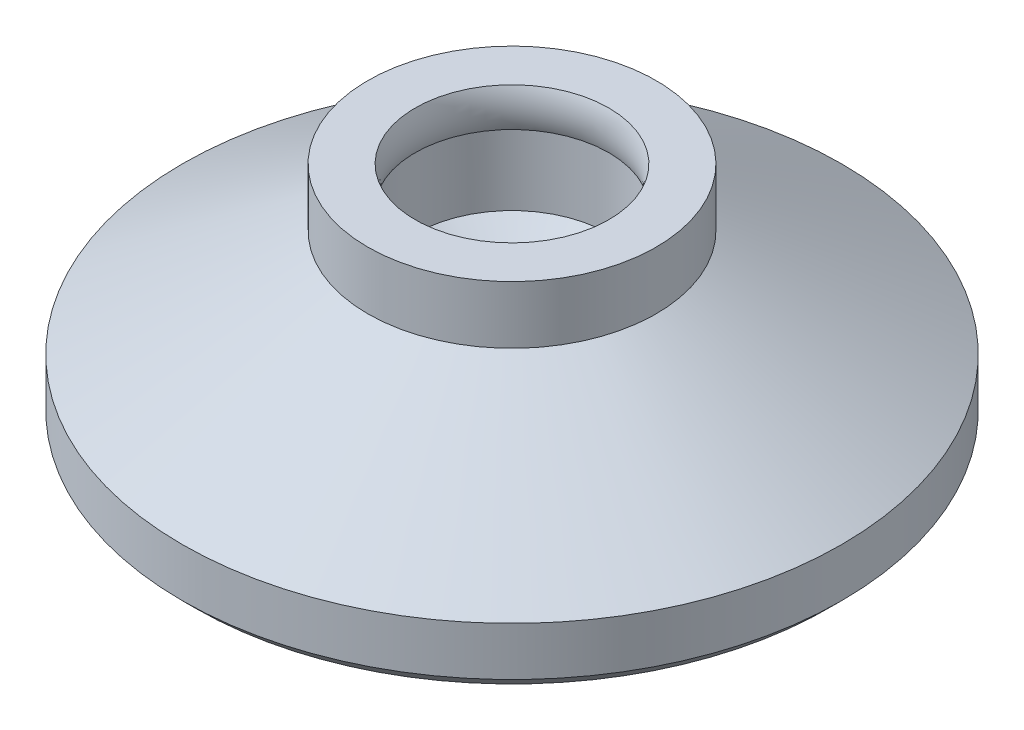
from build123d import *

# Parameters (mm, degrees)
SKETCH1_R      = 7
EXTRUDE1_DEPTH = 5.5
SKETCH3_R      = 16
EXTRUDE2_DEPTH = 3
CHAMFER1_SIZE  = 0.64


with BuildPart() as part:
    # Sketch1 → Extrude1 (new, symmetric)
    with BuildSketch(Plane(origin=(0, 0, 0), x_dir=(1, 0, 0), z_dir=(0, 1, 0))):
        with Locations(Location((0, 0, 0), (0, 0, 270))):
            Circle(SKETCH1_R)
    extrude(amount=EXTRUDE1_DEPTH, both=True)

    # Sketch3 → Extrude2 (add)
    with BuildSketch(Plane.XZ.offset(5.5)):
        with Locations(Location((0, 0, 0), (0, 0, 270))):
            Circle(SKETCH3_R)
    extrude(amount=-EXTRUDE2_DEPTH)

    # Sketch4 → Revolve1 (revolve)
    with BuildSketch(Plane.XY, mode=Mode.PRIVATE) as revolve1_sk:
        Polygon((-16, -2.5), (-7, 2.696152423), (-7, -2.5), align=None)
    revolve(revolve1_sk.sketch.rotate(Axis((0, 5.5, 0), (0, -1, 0)), 270), axis=Axis((0, 5.5, 0), (0, -1, 0)))

    # Chamfer1
    chamfer1_edges = [part.edges().sort_by_distance(p)[0] for p in [
        (0, -5.5, 16),
    ]]
    chamfer(chamfer1_edges, length=CHAMFER1_SIZE)

    # Sketch5 → Cut-Revolve1 (revolve, cut)
    with BuildSketch(Plane.XY, mode=Mode.PRIVATE) as cut_revolve1_sk:
        with BuildLine():
            Line((0, 5.5), (4.7, 5.5))
            ThreePointArc((4.7, 5.5), (4.512, 4.56), (4.7, 3.62))
            Line((4.7, 3.62), (4.7, 0.213546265))
            Line((4.7, 0.213546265), (0, -2.5))
            Line((0, -2.5), (0, 5.5))
        make_face()
    revolve(cut_revolve1_sk.sketch.rotate(Axis((0, 0, 0), (0, 1, 0)), 270), axis=Axis((0, 0, 0), (0, 1, 0)), mode=Mode.SUBTRACT)


solid = part.part
